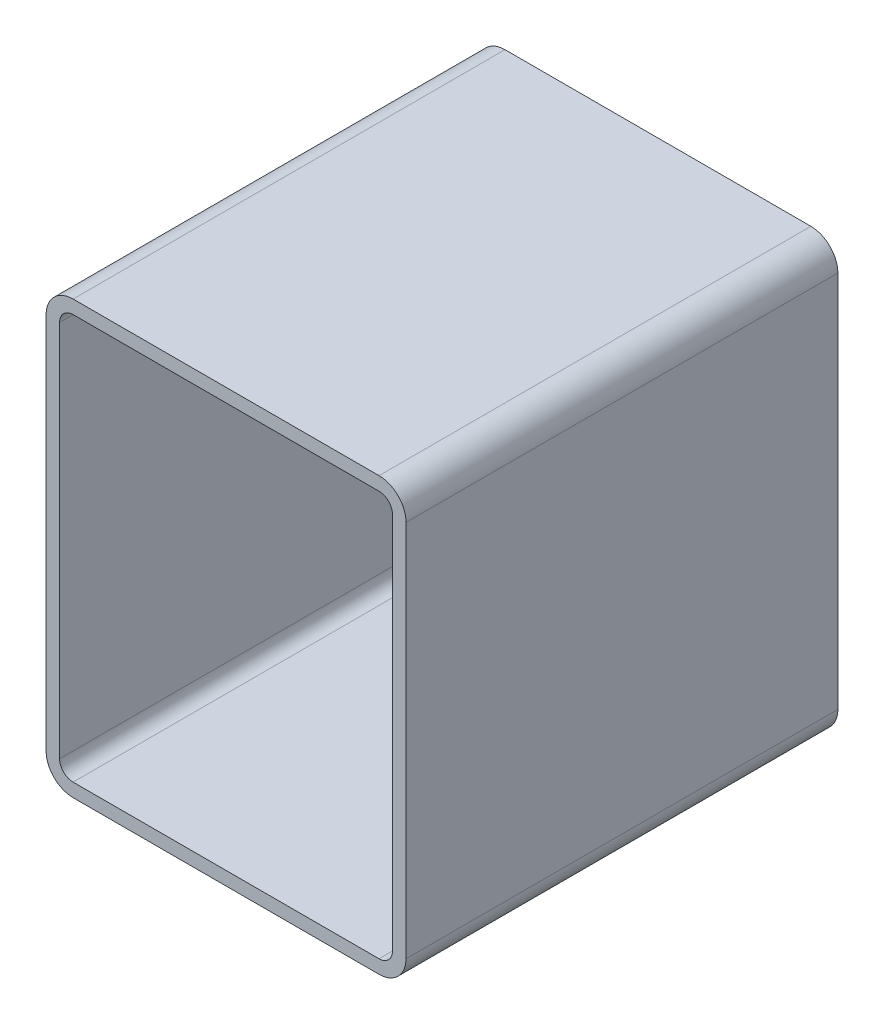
ISO-10303-21;
HEADER;
FILE_DESCRIPTION(('STEP AP214'),'2;1');
FILE_NAME('part.step','',(''),(''),'','','');
FILE_SCHEMA(('AUTOMOTIVE_DESIGN { 1 0 10303 214 1 1 1 1 }'));
ENDSEC;
DATA;
#1=APPLICATION_CONTEXT('core data for automotive mechanical design processes');
#2=APPLICATION_PROTOCOL_DEFINITION('international standard','automotive_design',2000,#1);
#3=PRODUCT_CONTEXT('',#1,'mechanical');
#4=PRODUCT('Part','Part','',(#3));
#5=PRODUCT_RELATED_PRODUCT_CATEGORY('part','',(#4));
#6=PRODUCT_DEFINITION_FORMATION('','',#4);
#7=PRODUCT_DEFINITION_CONTEXT('part definition',#1,'design');
#8=PRODUCT_DEFINITION('design','',#6,#7);
#9=PRODUCT_DEFINITION_SHAPE('','',#8);
#10=(LENGTH_UNIT() NAMED_UNIT(*) SI_UNIT(.MILLI.,.METRE.));
#11=(NAMED_UNIT(*) PLANE_ANGLE_UNIT() SI_UNIT($,.RADIAN.));
#12=(NAMED_UNIT(*) SI_UNIT($,.STERADIAN.) SOLID_ANGLE_UNIT());
#13=UNCERTAINTY_MEASURE_WITH_UNIT(LENGTH_MEASURE(1.E-05),#10,'distance_accuracy_value','');
#14=(GEOMETRIC_REPRESENTATION_CONTEXT(3) GLOBAL_UNCERTAINTY_ASSIGNED_CONTEXT((#13)) GLOBAL_UNIT_ASSIGNED_CONTEXT((#10,
#11,#12)) REPRESENTATION_CONTEXT('',''));
#15=CARTESIAN_POINT('',(0.,0.,0.));
#16=DIRECTION('',(0.,0.,1.));
#17=DIRECTION('',(1.,0.,0.));
#18=AXIS2_PLACEMENT_3D('',#15,#16,#17);
#19=CARTESIAN_POINT('',(21.7845794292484,287.624496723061,304.8));
#20=DIRECTION('',(0.,0.,1.));
#21=DIRECTION('',(1.,0.,0.));
#22=AXIS2_PLACEMENT_3D('',#19,#20,#21);
#23=PLANE('',#22);
#24=CARTESIAN_POINT('',(21.7845794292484,287.624496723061,304.8));
#25=DIRECTION('',(0.,0.,1.));
#26=DIRECTION('',(1.,0.,0.));
#27=AXIS2_PLACEMENT_3D('',#24,#25,#26);
#28=CIRCLE('',#27,19.05);
#29=CARTESIAN_POINT('',(21.7845794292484,306.674496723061,304.8));
#30=VERTEX_POINT('',#29);
#31=CARTESIAN_POINT('',(2.73457942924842,287.624496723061,304.8));
#32=VERTEX_POINT('',#31);
#33=EDGE_CURVE('E211',#30,#32,#28,.T.);
#34=ORIENTED_EDGE('',*,*,#33,.T.);
#35=DIRECTION('',(0.,-1.,0.));
#36=VECTOR('',#35,1.);
#37=CARTESIAN_POINT('',(2.73457942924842,20.9244967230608,304.8));
#38=LINE('',#37,#36);
#39=CARTESIAN_POINT('',(2.73457942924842,20.9244967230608,304.8));
#40=VERTEX_POINT('',#39);
#41=EDGE_CURVE('E214',#32,#40,#38,.T.);
#42=ORIENTED_EDGE('',*,*,#41,.T.);
#43=CARTESIAN_POINT('',(21.7845794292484,20.9244967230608,304.8));
#44=DIRECTION('',(0.,0.,1.));
#45=DIRECTION('',(1.,0.,0.));
#46=AXIS2_PLACEMENT_3D('',#43,#44,#45);
#47=CIRCLE('',#46,19.05);
#48=CARTESIAN_POINT('',(21.7845794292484,1.87449672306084,304.8));
#49=VERTEX_POINT('',#48);
#50=EDGE_CURVE('E217',#40,#49,#47,.T.);
#51=ORIENTED_EDGE('',*,*,#50,.T.);
#52=DIRECTION('',(1.,0.,0.));
#53=VECTOR('',#52,1.);
#54=CARTESIAN_POINT('',(237.684579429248,1.87449672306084,304.8));
#55=LINE('',#54,#53);
#56=CARTESIAN_POINT('',(237.684579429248,1.87449672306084,304.8));
#57=VERTEX_POINT('',#56);
#58=EDGE_CURVE('E219',#49,#57,#55,.T.);
#59=ORIENTED_EDGE('',*,*,#58,.T.);
#60=CARTESIAN_POINT('',(237.684579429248,20.9244967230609,304.8));
#61=DIRECTION('',(0.,0.,1.));
#62=DIRECTION('',(1.,0.,0.));
#63=AXIS2_PLACEMENT_3D('',#60,#61,#62);
#64=CIRCLE('',#63,19.05);
#65=CARTESIAN_POINT('',(256.734579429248,20.9244967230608,304.8));
#66=VERTEX_POINT('',#65);
#67=EDGE_CURVE('E221',#57,#66,#64,.T.);
#68=ORIENTED_EDGE('',*,*,#67,.T.);
#69=DIRECTION('',(0.,1.,0.));
#70=VECTOR('',#69,1.);
#71=CARTESIAN_POINT('',(256.734579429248,287.624496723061,304.8));
#72=LINE('',#71,#70);
#73=CARTESIAN_POINT('',(256.734579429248,287.624496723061,304.8));
#74=VERTEX_POINT('',#73);
#75=EDGE_CURVE('E223',#66,#74,#72,.T.);
#76=ORIENTED_EDGE('',*,*,#75,.T.);
#77=CARTESIAN_POINT('',(237.684579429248,287.624496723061,304.8));
#78=DIRECTION('',(0.,0.,1.));
#79=DIRECTION('',(1.,0.,0.));
#80=AXIS2_PLACEMENT_3D('',#77,#78,#79);
#81=CIRCLE('',#80,19.05);
#82=CARTESIAN_POINT('',(237.684579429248,306.674496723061,304.8));
#83=VERTEX_POINT('',#82);
#84=EDGE_CURVE('E225',#74,#83,#81,.T.);
#85=ORIENTED_EDGE('',*,*,#84,.T.);
#86=DIRECTION('',(-1.,0.,0.));
#87=VECTOR('',#86,1.);
#88=CARTESIAN_POINT('',(21.7845794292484,306.674496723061,304.8));
#89=LINE('',#88,#87);
#90=EDGE_CURVE('E227',#83,#30,#89,.T.);
#91=ORIENTED_EDGE('',*,*,#90,.T.);
#92=EDGE_LOOP('',(#34,#42,#51,#59,#68,#76,#85,#91));
#93=FACE_BOUND('',#92,.T.);
#94=DIRECTION('',(0.,-1.,0.));
#95=VECTOR('',#94,1.);
#96=CARTESIAN_POINT('',(12.2595794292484,20.9244967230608,304.8));
#97=LINE('',#96,#95);
#98=CARTESIAN_POINT('',(12.2595794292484,287.624496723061,304.8));
#99=VERTEX_POINT('',#98);
#100=CARTESIAN_POINT('',(12.2595794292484,20.9244967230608,304.8));
#101=VERTEX_POINT('',#100);
#102=EDGE_CURVE('E154',#99,#101,#97,.T.);
#103=ORIENTED_EDGE('',*,*,#102,.F.);
#104=CARTESIAN_POINT('',(21.7845794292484,287.624496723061,304.8));
#105=DIRECTION('',(0.,0.,1.));
#106=DIRECTION('',(1.,0.,0.));
#107=AXIS2_PLACEMENT_3D('',#104,#105,#106);
#108=CIRCLE('',#107,9.52500000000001);
#109=CARTESIAN_POINT('',(21.7845794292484,297.149496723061,304.8));
#110=VERTEX_POINT('',#109);
#111=EDGE_CURVE('E146',#110,#99,#108,.T.);
#112=ORIENTED_EDGE('',*,*,#111,.F.);
#113=DIRECTION('',(-1.,0.,0.));
#114=VECTOR('',#113,1.);
#115=CARTESIAN_POINT('',(21.7845794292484,297.149496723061,304.8));
#116=LINE('',#115,#114);
#117=CARTESIAN_POINT('',(237.684579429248,297.149496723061,304.8));
#118=VERTEX_POINT('',#117);
#119=EDGE_CURVE('E179',#118,#110,#116,.T.);
#120=ORIENTED_EDGE('',*,*,#119,.F.);
#121=CARTESIAN_POINT('',(237.684579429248,287.624496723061,304.8));
#122=DIRECTION('',(0.,0.,1.));
#123=DIRECTION('',(1.,0.,0.));
#124=AXIS2_PLACEMENT_3D('',#121,#122,#123);
#125=CIRCLE('',#124,9.52500000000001);
#126=CARTESIAN_POINT('',(247.209579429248,287.624496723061,304.8));
#127=VERTEX_POINT('',#126);
#128=EDGE_CURVE('E177',#127,#118,#125,.T.);
#129=ORIENTED_EDGE('',*,*,#128,.F.);
#130=DIRECTION('',(0.,1.,0.));
#131=VECTOR('',#130,1.);
#132=CARTESIAN_POINT('',(247.209579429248,287.624496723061,304.8));
#133=LINE('',#132,#131);
#134=CARTESIAN_POINT('',(247.209579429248,20.9244967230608,304.8));
#135=VERTEX_POINT('',#134);
#136=EDGE_CURVE('E175',#135,#127,#133,.T.);
#137=ORIENTED_EDGE('',*,*,#136,.F.);
#138=CARTESIAN_POINT('',(237.684579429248,20.9244967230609,304.8));
#139=DIRECTION('',(0.,0.,1.));
#140=DIRECTION('',(1.,0.,0.));
#141=AXIS2_PLACEMENT_3D('',#138,#139,#140);
#142=CIRCLE('',#141,9.52500000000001);
#143=CARTESIAN_POINT('',(237.684579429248,11.3994967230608,304.8));
#144=VERTEX_POINT('',#143);
#145=EDGE_CURVE('E173',#144,#135,#142,.T.);
#146=ORIENTED_EDGE('',*,*,#145,.F.);
#147=DIRECTION('',(1.,0.,0.));
#148=VECTOR('',#147,1.);
#149=CARTESIAN_POINT('',(237.684579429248,11.3994967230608,304.8));
#150=LINE('',#149,#148);
#151=CARTESIAN_POINT('',(21.7845794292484,11.3994967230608,304.8));
#152=VERTEX_POINT('',#151);
#153=EDGE_CURVE('E169',#152,#144,#150,.T.);
#154=ORIENTED_EDGE('',*,*,#153,.F.);
#155=CARTESIAN_POINT('',(21.7845794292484,20.9244967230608,304.8));
#156=DIRECTION('',(0.,0.,1.));
#157=DIRECTION('',(1.,0.,0.));
#158=AXIS2_PLACEMENT_3D('',#155,#156,#157);
#159=CIRCLE('',#158,9.525);
#160=EDGE_CURVE('E167',#101,#152,#159,.T.);
#161=ORIENTED_EDGE('',*,*,#160,.F.);
#162=EDGE_LOOP('',(#103,#112,#120,#129,#137,#146,#154,#161));
#163=FACE_BOUND('',#162,.T.);
#164=ADVANCED_FACE('F33',(#93,#163),#23,.T.);
#165=CARTESIAN_POINT('',(21.7845794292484,287.624496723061,0.));
#166=DIRECTION('',(0.,0.,1.));
#167=DIRECTION('',(1.,0.,0.));
#168=AXIS2_PLACEMENT_3D('',#165,#166,#167);
#169=PLANE('',#168);
#170=CARTESIAN_POINT('',(21.7845794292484,287.624496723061,0.));
#171=DIRECTION('',(0.,0.,1.));
#172=DIRECTION('',(1.,0.,0.));
#173=AXIS2_PLACEMENT_3D('',#170,#171,#172);
#174=CIRCLE('',#173,19.05);
#175=CARTESIAN_POINT('',(21.7845794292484,306.674496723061,0.));
#176=VERTEX_POINT('',#175);
#177=CARTESIAN_POINT('',(2.73457942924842,287.624496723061,0.));
#178=VERTEX_POINT('',#177);
#179=EDGE_CURVE('E162',#176,#178,#174,.T.);
#180=ORIENTED_EDGE('',*,*,#179,.F.);
#181=DIRECTION('',(-1.,0.,0.));
#182=VECTOR('',#181,1.);
#183=CARTESIAN_POINT('',(21.7845794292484,306.674496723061,0.));
#184=LINE('',#183,#182);
#185=CARTESIAN_POINT('',(237.684579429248,306.674496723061,0.));
#186=VERTEX_POINT('',#185);
#187=EDGE_CURVE('E215',#186,#176,#184,.T.);
#188=ORIENTED_EDGE('',*,*,#187,.F.);
#189=CARTESIAN_POINT('',(237.684579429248,287.624496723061,0.));
#190=DIRECTION('',(0.,0.,1.));
#191=DIRECTION('',(1.,0.,0.));
#192=AXIS2_PLACEMENT_3D('',#189,#190,#191);
#193=CIRCLE('',#192,19.05);
#194=CARTESIAN_POINT('',(256.734579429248,287.624496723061,0.));
#195=VERTEX_POINT('',#194);
#196=EDGE_CURVE('E242',#195,#186,#193,.T.);
#197=ORIENTED_EDGE('',*,*,#196,.F.);
#198=DIRECTION('',(0.,1.,0.));
#199=VECTOR('',#198,1.);
#200=CARTESIAN_POINT('',(256.734579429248,287.624496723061,0.));
#201=LINE('',#200,#199);
#202=CARTESIAN_POINT('',(256.734579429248,20.9244967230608,0.));
#203=VERTEX_POINT('',#202);
#204=EDGE_CURVE('E240',#203,#195,#201,.T.);
#205=ORIENTED_EDGE('',*,*,#204,.F.);
#206=CARTESIAN_POINT('',(237.684579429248,20.9244967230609,0.));
#207=DIRECTION('',(0.,0.,1.));
#208=DIRECTION('',(1.,0.,0.));
#209=AXIS2_PLACEMENT_3D('',#206,#207,#208);
#210=CIRCLE('',#209,19.05);
#211=CARTESIAN_POINT('',(237.684579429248,1.87449672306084,0.));
#212=VERTEX_POINT('',#211);
#213=EDGE_CURVE('E238',#212,#203,#210,.T.);
#214=ORIENTED_EDGE('',*,*,#213,.F.);
#215=DIRECTION('',(1.,0.,0.));
#216=VECTOR('',#215,1.);
#217=CARTESIAN_POINT('',(237.684579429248,1.87449672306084,0.));
#218=LINE('',#217,#216);
#219=CARTESIAN_POINT('',(21.7845794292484,1.87449672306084,0.));
#220=VERTEX_POINT('',#219);
#221=EDGE_CURVE('E236',#220,#212,#218,.T.);
#222=ORIENTED_EDGE('',*,*,#221,.F.);
#223=CARTESIAN_POINT('',(21.7845794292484,20.9244967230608,0.));
#224=DIRECTION('',(0.,0.,1.));
#225=DIRECTION('',(1.,0.,0.));
#226=AXIS2_PLACEMENT_3D('',#223,#224,#225);
#227=CIRCLE('',#226,19.05);
#228=CARTESIAN_POINT('',(2.73457942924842,20.9244967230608,0.));
#229=VERTEX_POINT('',#228);
#230=EDGE_CURVE('E234',#229,#220,#227,.T.);
#231=ORIENTED_EDGE('',*,*,#230,.F.);
#232=DIRECTION('',(0.,-1.,0.));
#233=VECTOR('',#232,1.);
#234=CARTESIAN_POINT('',(2.73457942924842,20.9244967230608,0.));
#235=LINE('',#234,#233);
#236=EDGE_CURVE('E232',#178,#229,#235,.T.);
#237=ORIENTED_EDGE('',*,*,#236,.F.);
#238=EDGE_LOOP('',(#180,#188,#197,#205,#214,#222,#231,#237));
#239=FACE_BOUND('',#238,.T.);
#240=CARTESIAN_POINT('',(21.7845794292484,287.624496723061,0.));
#241=DIRECTION('',(0.,0.,1.));
#242=DIRECTION('',(1.,0.,0.));
#243=AXIS2_PLACEMENT_3D('',#240,#241,#242);
#244=CIRCLE('',#243,9.52500000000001);
#245=CARTESIAN_POINT('',(21.7845794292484,297.149496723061,0.));
#246=VERTEX_POINT('',#245);
#247=CARTESIAN_POINT('',(12.2595794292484,287.624496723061,0.));
#248=VERTEX_POINT('',#247);
#249=EDGE_CURVE('E56',#246,#248,#244,.T.);
#250=ORIENTED_EDGE('',*,*,#249,.T.);
#251=DIRECTION('',(0.,-1.,0.));
#252=VECTOR('',#251,1.);
#253=CARTESIAN_POINT('',(12.2595794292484,20.9244967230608,0.));
#254=LINE('',#253,#252);
#255=CARTESIAN_POINT('',(12.2595794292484,20.9244967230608,0.));
#256=VERTEX_POINT('',#255);
#257=EDGE_CURVE('E161',#248,#256,#254,.T.);
#258=ORIENTED_EDGE('',*,*,#257,.T.);
#259=CARTESIAN_POINT('',(21.7845794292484,20.9244967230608,0.));
#260=DIRECTION('',(0.,0.,1.));
#261=DIRECTION('',(1.,0.,0.));
#262=AXIS2_PLACEMENT_3D('',#259,#260,#261);
#263=CIRCLE('',#262,9.525);
#264=CARTESIAN_POINT('',(21.7845794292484,11.3994967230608,0.));
#265=VERTEX_POINT('',#264);
#266=EDGE_CURVE('E183',#256,#265,#263,.T.);
#267=ORIENTED_EDGE('',*,*,#266,.T.);
#268=DIRECTION('',(1.,0.,0.));
#269=VECTOR('',#268,1.);
#270=CARTESIAN_POINT('',(237.684579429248,11.3994967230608,0.));
#271=LINE('',#270,#269);
#272=CARTESIAN_POINT('',(237.684579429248,11.3994967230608,0.));
#273=VERTEX_POINT('',#272);
#274=EDGE_CURVE('E186',#265,#273,#271,.T.);
#275=ORIENTED_EDGE('',*,*,#274,.T.);
#276=CARTESIAN_POINT('',(237.684579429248,20.9244967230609,0.));
#277=DIRECTION('',(0.,0.,1.));
#278=DIRECTION('',(1.,0.,0.));
#279=AXIS2_PLACEMENT_3D('',#276,#277,#278);
#280=CIRCLE('',#279,9.52500000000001);
#281=CARTESIAN_POINT('',(247.209579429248,20.9244967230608,0.));
#282=VERTEX_POINT('',#281);
#283=EDGE_CURVE('E189',#273,#282,#280,.T.);
#284=ORIENTED_EDGE('',*,*,#283,.T.);
#285=DIRECTION('',(0.,1.,0.));
#286=VECTOR('',#285,1.);
#287=CARTESIAN_POINT('',(247.209579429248,287.624496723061,0.));
#288=LINE('',#287,#286);
#289=CARTESIAN_POINT('',(247.209579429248,287.624496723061,0.));
#290=VERTEX_POINT('',#289);
#291=EDGE_CURVE('E192',#282,#290,#288,.T.);
#292=ORIENTED_EDGE('',*,*,#291,.T.);
#293=CARTESIAN_POINT('',(237.684579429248,287.624496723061,0.));
#294=DIRECTION('',(0.,0.,1.));
#295=DIRECTION('',(1.,0.,0.));
#296=AXIS2_PLACEMENT_3D('',#293,#294,#295);
#297=CIRCLE('',#296,9.52500000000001);
#298=CARTESIAN_POINT('',(237.684579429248,297.149496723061,0.));
#299=VERTEX_POINT('',#298);
#300=EDGE_CURVE('E195',#290,#299,#297,.T.);
#301=ORIENTED_EDGE('',*,*,#300,.T.);
#302=DIRECTION('',(-1.,0.,0.));
#303=VECTOR('',#302,1.);
#304=CARTESIAN_POINT('',(21.7845794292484,297.149496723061,0.));
#305=LINE('',#304,#303);
#306=EDGE_CURVE('E155',#299,#246,#305,.T.);
#307=ORIENTED_EDGE('',*,*,#306,.T.);
#308=EDGE_LOOP('',(#250,#258,#267,#275,#284,#292,#301,#307));
#309=FACE_BOUND('',#308,.T.);
#310=ADVANCED_FACE('F272',(#239,#309),#169,.F.);
#311=CARTESIAN_POINT('',(21.7845794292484,287.624496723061,304.8));
#312=DIRECTION('',(0.,0.,-1.));
#313=DIRECTION('',(-1.,0.,0.));
#314=AXIS2_PLACEMENT_3D('',#311,#312,#313);
#315=CYLINDRICAL_SURFACE('',#314,19.05);
#316=ORIENTED_EDGE('',*,*,#179,.T.);
#317=DIRECTION('',(0.,0.,-1.));
#318=VECTOR('',#317,1.);
#319=CARTESIAN_POINT('',(2.73457942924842,287.624496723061,304.8));
#320=LINE('',#319,#318);
#321=EDGE_CURVE('E11',#32,#178,#320,.T.);
#322=ORIENTED_EDGE('',*,*,#321,.F.);
#323=ORIENTED_EDGE('',*,*,#33,.F.);
#324=DIRECTION('',(0.,0.,-1.));
#325=VECTOR('',#324,1.);
#326=CARTESIAN_POINT('',(21.7845794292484,306.674496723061,304.8));
#327=LINE('',#326,#325);
#328=EDGE_CURVE('E229',#30,#176,#327,.T.);
#329=ORIENTED_EDGE('',*,*,#328,.T.);
#330=EDGE_LOOP('',(#316,#322,#323,#329));
#331=FACE_BOUND('',#330,.T.);
#332=ADVANCED_FACE('F35',(#331),#315,.T.);
#333=CARTESIAN_POINT('',(2.73457942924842,20.9244967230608,304.8));
#334=DIRECTION('',(1.,0.,0.));
#335=DIRECTION('',(0.,0.,-1.));
#336=AXIS2_PLACEMENT_3D('',#333,#334,#335);
#337=PLANE('',#336);
#338=ORIENTED_EDGE('',*,*,#236,.T.);
#339=DIRECTION('',(0.,0.,-1.));
#340=VECTOR('',#339,1.);
#341=CARTESIAN_POINT('',(2.73457942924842,20.9244967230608,304.8));
#342=LINE('',#341,#340);
#343=EDGE_CURVE('E41',#40,#229,#342,.T.);
#344=ORIENTED_EDGE('',*,*,#343,.F.);
#345=ORIENTED_EDGE('',*,*,#41,.F.);
#346=ORIENTED_EDGE('',*,*,#321,.T.);
#347=EDGE_LOOP('',(#338,#344,#345,#346));
#348=FACE_BOUND('',#347,.T.);
#349=ADVANCED_FACE('F289',(#348),#337,.F.);
#350=CARTESIAN_POINT('',(21.7845794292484,20.9244967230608,304.8));
#351=DIRECTION('',(0.,0.,-1.));
#352=DIRECTION('',(-1.,0.,0.));
#353=AXIS2_PLACEMENT_3D('',#350,#351,#352);
#354=CYLINDRICAL_SURFACE('',#353,19.05);
#355=ORIENTED_EDGE('',*,*,#230,.T.);
#356=DIRECTION('',(0.,0.,-1.));
#357=VECTOR('',#356,1.);
#358=CARTESIAN_POINT('',(21.7845794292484,1.87449672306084,304.8));
#359=LINE('',#358,#357);
#360=EDGE_CURVE('E259',#49,#220,#359,.T.);
#361=ORIENTED_EDGE('',*,*,#360,.F.);
#362=ORIENTED_EDGE('',*,*,#50,.F.);
#363=ORIENTED_EDGE('',*,*,#343,.T.);
#364=EDGE_LOOP('',(#355,#361,#362,#363));
#365=FACE_BOUND('',#364,.T.);
#366=ADVANCED_FACE('F266',(#365),#354,.T.);
#367=CARTESIAN_POINT('',(237.684579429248,1.87449672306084,304.8));
#368=DIRECTION('',(0.,1.,0.));
#369=DIRECTION('',(0.,0.,1.));
#370=AXIS2_PLACEMENT_3D('',#367,#368,#369);
#371=PLANE('',#370);
#372=ORIENTED_EDGE('',*,*,#221,.T.);
#373=DIRECTION('',(0.,0.,-1.));
#374=VECTOR('',#373,1.);
#375=CARTESIAN_POINT('',(237.684579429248,1.87449672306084,304.8));
#376=LINE('',#375,#374);
#377=EDGE_CURVE('E256',#57,#212,#376,.T.);
#378=ORIENTED_EDGE('',*,*,#377,.F.);
#379=ORIENTED_EDGE('',*,*,#58,.F.);
#380=ORIENTED_EDGE('',*,*,#360,.T.);
#381=EDGE_LOOP('',(#372,#378,#379,#380));
#382=FACE_BOUND('',#381,.T.);
#383=ADVANCED_FACE('F278',(#382),#371,.F.);
#384=CARTESIAN_POINT('',(237.684579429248,20.9244967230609,304.8));
#385=DIRECTION('',(0.,0.,-1.));
#386=DIRECTION('',(-1.,0.,0.));
#387=AXIS2_PLACEMENT_3D('',#384,#385,#386);
#388=CYLINDRICAL_SURFACE('',#387,19.05);
#389=ORIENTED_EDGE('',*,*,#213,.T.);
#390=DIRECTION('',(0.,0.,-1.));
#391=VECTOR('',#390,1.);
#392=CARTESIAN_POINT('',(256.734579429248,20.9244967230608,304.8));
#393=LINE('',#392,#391);
#394=EDGE_CURVE('E253',#66,#203,#393,.T.);
#395=ORIENTED_EDGE('',*,*,#394,.F.);
#396=ORIENTED_EDGE('',*,*,#67,.F.);
#397=ORIENTED_EDGE('',*,*,#377,.T.);
#398=EDGE_LOOP('',(#389,#395,#396,#397));
#399=FACE_BOUND('',#398,.T.);
#400=ADVANCED_FACE('F282',(#399),#388,.T.);
#401=CARTESIAN_POINT('',(256.734579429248,287.624496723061,304.8));
#402=DIRECTION('',(-1.,0.,0.));
#403=DIRECTION('',(0.,0.,1.));
#404=AXIS2_PLACEMENT_3D('',#401,#402,#403);
#405=PLANE('',#404);
#406=ORIENTED_EDGE('',*,*,#204,.T.);
#407=DIRECTION('',(0.,0.,-1.));
#408=VECTOR('',#407,1.);
#409=CARTESIAN_POINT('',(256.734579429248,287.624496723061,304.8));
#410=LINE('',#409,#408);
#411=EDGE_CURVE('E250',#74,#195,#410,.T.);
#412=ORIENTED_EDGE('',*,*,#411,.F.);
#413=ORIENTED_EDGE('',*,*,#75,.F.);
#414=ORIENTED_EDGE('',*,*,#394,.T.);
#415=EDGE_LOOP('',(#406,#412,#413,#414));
#416=FACE_BOUND('',#415,.T.);
#417=ADVANCED_FACE('F302',(#416),#405,.F.);
#418=CARTESIAN_POINT('',(237.684579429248,287.624496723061,304.8));
#419=DIRECTION('',(0.,0.,-1.));
#420=DIRECTION('',(-1.,0.,0.));
#421=AXIS2_PLACEMENT_3D('',#418,#419,#420);
#422=CYLINDRICAL_SURFACE('',#421,19.05);
#423=ORIENTED_EDGE('',*,*,#196,.T.);
#424=DIRECTION('',(0.,0.,-1.));
#425=VECTOR('',#424,1.);
#426=CARTESIAN_POINT('',(237.684579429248,306.674496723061,304.8));
#427=LINE('',#426,#425);
#428=EDGE_CURVE('E247',#83,#186,#427,.T.);
#429=ORIENTED_EDGE('',*,*,#428,.F.);
#430=ORIENTED_EDGE('',*,*,#84,.F.);
#431=ORIENTED_EDGE('',*,*,#411,.T.);
#432=EDGE_LOOP('',(#423,#429,#430,#431));
#433=FACE_BOUND('',#432,.T.);
#434=ADVANCED_FACE('F300',(#433),#422,.T.);
#435=CARTESIAN_POINT('',(21.7845794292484,306.674496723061,304.8));
#436=DIRECTION('',(0.,-1.,0.));
#437=DIRECTION('',(0.,0.,-1.));
#438=AXIS2_PLACEMENT_3D('',#435,#436,#437);
#439=PLANE('',#438);
#440=ORIENTED_EDGE('',*,*,#187,.T.);
#441=ORIENTED_EDGE('',*,*,#328,.F.);
#442=ORIENTED_EDGE('',*,*,#90,.F.);
#443=ORIENTED_EDGE('',*,*,#428,.T.);
#444=EDGE_LOOP('',(#440,#441,#442,#443));
#445=FACE_BOUND('',#444,.T.);
#446=ADVANCED_FACE('F295',(#445),#439,.F.);
#447=CARTESIAN_POINT('',(21.7845794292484,287.624496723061,304.8));
#448=DIRECTION('',(0.,0.,-1.));
#449=DIRECTION('',(-1.,0.,0.));
#450=AXIS2_PLACEMENT_3D('',#447,#448,#449);
#451=CYLINDRICAL_SURFACE('',#450,9.52500000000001);
#452=ORIENTED_EDGE('',*,*,#249,.F.);
#453=DIRECTION('',(0.,0.,-1.));
#454=VECTOR('',#453,1.);
#455=CARTESIAN_POINT('',(21.7845794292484,297.149496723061,304.8));
#456=LINE('',#455,#454);
#457=EDGE_CURVE('E150',#110,#246,#456,.T.);
#458=ORIENTED_EDGE('',*,*,#457,.F.);
#459=ORIENTED_EDGE('',*,*,#111,.T.);
#460=DIRECTION('',(0.,0.,-1.));
#461=VECTOR('',#460,1.);
#462=CARTESIAN_POINT('',(12.2595794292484,287.624496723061,304.8));
#463=LINE('',#462,#461);
#464=EDGE_CURVE('E149',#99,#248,#463,.T.);
#465=ORIENTED_EDGE('',*,*,#464,.T.);
#466=EDGE_LOOP('',(#452,#458,#459,#465));
#467=FACE_BOUND('',#466,.T.);
#468=ADVANCED_FACE('F148',(#467),#451,.F.);
#469=CARTESIAN_POINT('',(12.2595794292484,20.9244967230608,304.8));
#470=DIRECTION('',(1.,0.,0.));
#471=DIRECTION('',(0.,0.,-1.));
#472=AXIS2_PLACEMENT_3D('',#469,#470,#471);
#473=PLANE('',#472);
#474=ORIENTED_EDGE('',*,*,#257,.F.);
#475=ORIENTED_EDGE('',*,*,#464,.F.);
#476=ORIENTED_EDGE('',*,*,#102,.T.);
#477=DIRECTION('',(0.,0.,-1.));
#478=VECTOR('',#477,1.);
#479=CARTESIAN_POINT('',(12.2595794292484,20.9244967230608,304.8));
#480=LINE('',#479,#478);
#481=EDGE_CURVE('E163',#101,#256,#480,.T.);
#482=ORIENTED_EDGE('',*,*,#481,.T.);
#483=EDGE_LOOP('',(#474,#475,#476,#482));
#484=FACE_BOUND('',#483,.T.);
#485=ADVANCED_FACE('F158',(#484),#473,.T.);
#486=CARTESIAN_POINT('',(21.7845794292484,20.9244967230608,304.8));
#487=DIRECTION('',(0.,0.,-1.));
#488=DIRECTION('',(-1.,0.,0.));
#489=AXIS2_PLACEMENT_3D('',#486,#487,#488);
#490=CYLINDRICAL_SURFACE('',#489,9.525);
#491=ORIENTED_EDGE('',*,*,#266,.F.);
#492=ORIENTED_EDGE('',*,*,#481,.F.);
#493=ORIENTED_EDGE('',*,*,#160,.T.);
#494=DIRECTION('',(0.,0.,-1.));
#495=VECTOR('',#494,1.);
#496=CARTESIAN_POINT('',(21.7845794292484,11.3994967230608,304.8));
#497=LINE('',#496,#495);
#498=EDGE_CURVE('E208',#152,#265,#497,.T.);
#499=ORIENTED_EDGE('',*,*,#498,.T.);
#500=EDGE_LOOP('',(#491,#492,#493,#499));
#501=FACE_BOUND('',#500,.T.);
#502=ADVANCED_FACE('F327',(#501),#490,.F.);
#503=CARTESIAN_POINT('',(237.684579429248,11.3994967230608,304.8));
#504=DIRECTION('',(0.,1.,0.));
#505=DIRECTION('',(0.,0.,1.));
#506=AXIS2_PLACEMENT_3D('',#503,#504,#505);
#507=PLANE('',#506);
#508=ORIENTED_EDGE('',*,*,#274,.F.);
#509=ORIENTED_EDGE('',*,*,#498,.F.);
#510=ORIENTED_EDGE('',*,*,#153,.T.);
#511=DIRECTION('',(0.,0.,-1.));
#512=VECTOR('',#511,1.);
#513=CARTESIAN_POINT('',(237.684579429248,11.3994967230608,304.8));
#514=LINE('',#513,#512);
#515=EDGE_CURVE('E206',#144,#273,#514,.T.);
#516=ORIENTED_EDGE('',*,*,#515,.T.);
#517=EDGE_LOOP('',(#508,#509,#510,#516));
#518=FACE_BOUND('',#517,.T.);
#519=ADVANCED_FACE('F331',(#518),#507,.T.);
#520=CARTESIAN_POINT('',(237.684579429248,20.9244967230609,304.8));
#521=DIRECTION('',(0.,0.,-1.));
#522=DIRECTION('',(-1.,0.,0.));
#523=AXIS2_PLACEMENT_3D('',#520,#521,#522);
#524=CYLINDRICAL_SURFACE('',#523,9.52500000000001);
#525=ORIENTED_EDGE('',*,*,#283,.F.);
#526=ORIENTED_EDGE('',*,*,#515,.F.);
#527=ORIENTED_EDGE('',*,*,#145,.T.);
#528=DIRECTION('',(0.,0.,-1.));
#529=VECTOR('',#528,1.);
#530=CARTESIAN_POINT('',(247.209579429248,20.9244967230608,304.8));
#531=LINE('',#530,#529);
#532=EDGE_CURVE('E204',#135,#282,#531,.T.);
#533=ORIENTED_EDGE('',*,*,#532,.T.);
#534=EDGE_LOOP('',(#525,#526,#527,#533));
#535=FACE_BOUND('',#534,.T.);
#536=ADVANCED_FACE('F337',(#535),#524,.F.);
#537=CARTESIAN_POINT('',(247.209579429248,287.624496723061,304.8));
#538=DIRECTION('',(-1.,0.,0.));
#539=DIRECTION('',(0.,0.,1.));
#540=AXIS2_PLACEMENT_3D('',#537,#538,#539);
#541=PLANE('',#540);
#542=ORIENTED_EDGE('',*,*,#291,.F.);
#543=ORIENTED_EDGE('',*,*,#532,.F.);
#544=ORIENTED_EDGE('',*,*,#136,.T.);
#545=DIRECTION('',(0.,0.,-1.));
#546=VECTOR('',#545,1.);
#547=CARTESIAN_POINT('',(247.209579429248,287.624496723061,304.8));
#548=LINE('',#547,#546);
#549=EDGE_CURVE('E202',#127,#290,#548,.T.);
#550=ORIENTED_EDGE('',*,*,#549,.T.);
#551=EDGE_LOOP('',(#542,#543,#544,#550));
#552=FACE_BOUND('',#551,.T.);
#553=ADVANCED_FACE('F341',(#552),#541,.T.);
#554=CARTESIAN_POINT('',(237.684579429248,287.624496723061,304.8));
#555=DIRECTION('',(0.,0.,-1.));
#556=DIRECTION('',(-1.,0.,0.));
#557=AXIS2_PLACEMENT_3D('',#554,#555,#556);
#558=CYLINDRICAL_SURFACE('',#557,9.52500000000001);
#559=ORIENTED_EDGE('',*,*,#300,.F.);
#560=ORIENTED_EDGE('',*,*,#549,.F.);
#561=ORIENTED_EDGE('',*,*,#128,.T.);
#562=DIRECTION('',(0.,0.,-1.));
#563=VECTOR('',#562,1.);
#564=CARTESIAN_POINT('',(237.684579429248,297.149496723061,304.8));
#565=LINE('',#564,#563);
#566=EDGE_CURVE('E48',#118,#299,#565,.T.);
#567=ORIENTED_EDGE('',*,*,#566,.T.);
#568=EDGE_LOOP('',(#559,#560,#561,#567));
#569=FACE_BOUND('',#568,.T.);
#570=ADVANCED_FACE('F345',(#569),#558,.F.);
#571=CARTESIAN_POINT('',(21.7845794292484,297.149496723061,304.8));
#572=DIRECTION('',(0.,-1.,0.));
#573=DIRECTION('',(0.,0.,-1.));
#574=AXIS2_PLACEMENT_3D('',#571,#572,#573);
#575=PLANE('',#574);
#576=ORIENTED_EDGE('',*,*,#306,.F.);
#577=ORIENTED_EDGE('',*,*,#566,.F.);
#578=ORIENTED_EDGE('',*,*,#119,.T.);
#579=ORIENTED_EDGE('',*,*,#457,.T.);
#580=EDGE_LOOP('',(#576,#577,#578,#579));
#581=FACE_BOUND('',#580,.T.);
#582=ADVANCED_FACE('F349',(#581),#575,.T.);
#583=CLOSED_SHELL('',(#164,#310,#332,#349,#366,#383,#400,#417,#434,#446,#468,#485,#502,#519,
#536,#553,#570,#582));
#584=MANIFOLD_SOLID_BREP('B2',#583);
#585=ADVANCED_BREP_SHAPE_REPRESENTATION('',(#18,#584),#14);
#586=SHAPE_DEFINITION_REPRESENTATION(#9,#585);
ENDSEC;
END-ISO-10303-21;
